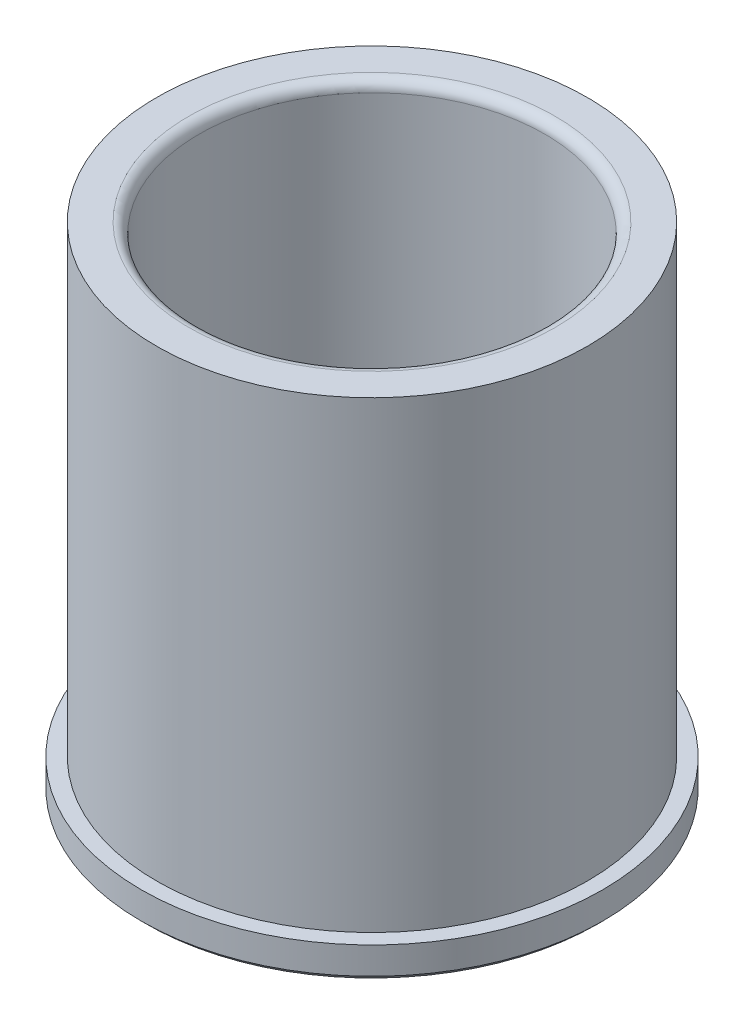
ISO-10303-21;
HEADER;
FILE_DESCRIPTION(('STEP AP214'),'2;1');
FILE_NAME('part.step','',(''),(''),'','','');
FILE_SCHEMA(('AUTOMOTIVE_DESIGN { 1 0 10303 214 1 1 1 1 }'));
ENDSEC;
DATA;
#1=APPLICATION_CONTEXT('core data for automotive mechanical design processes');
#2=APPLICATION_PROTOCOL_DEFINITION('international standard','automotive_design',2000,#1);
#3=PRODUCT_CONTEXT('',#1,'mechanical');
#4=PRODUCT('Part','Part','',(#3));
#5=PRODUCT_RELATED_PRODUCT_CATEGORY('part','',(#4));
#6=PRODUCT_DEFINITION_FORMATION('','',#4);
#7=PRODUCT_DEFINITION_CONTEXT('part definition',#1,'design');
#8=PRODUCT_DEFINITION('design','',#6,#7);
#9=PRODUCT_DEFINITION_SHAPE('','',#8);
#10=(LENGTH_UNIT() NAMED_UNIT(*) SI_UNIT(.MILLI.,.METRE.));
#11=(NAMED_UNIT(*) PLANE_ANGLE_UNIT() SI_UNIT($,.RADIAN.));
#12=(NAMED_UNIT(*) SI_UNIT($,.STERADIAN.) SOLID_ANGLE_UNIT());
#13=UNCERTAINTY_MEASURE_WITH_UNIT(LENGTH_MEASURE(1.E-05),#10,'distance_accuracy_value','');
#14=(GEOMETRIC_REPRESENTATION_CONTEXT(3) GLOBAL_UNCERTAINTY_ASSIGNED_CONTEXT((#13)) GLOBAL_UNIT_ASSIGNED_CONTEXT((#10,
#11,#12)) REPRESENTATION_CONTEXT('',''));
#15=CARTESIAN_POINT('',(0.,0.,0.));
#16=DIRECTION('',(0.,0.,1.));
#17=DIRECTION('',(1.,0.,0.));
#18=AXIS2_PLACEMENT_3D('',#15,#16,#17);
#19=CARTESIAN_POINT('',(3.49148336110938E-12,-1000.,0.));
#20=DIRECTION('',(0.,-1.,0.));
#21=DIRECTION('',(1.,0.,0.));
#22=AXIS2_PLACEMENT_3D('',#19,#20,#21);
#23=CYLINDRICAL_SURFACE('',#22,31.7563499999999);
#24=CARTESIAN_POINT('',(0.,4.7625,0.));
#25=DIRECTION('',(0.,-1.,0.));
#26=DIRECTION('',(1.,0.,0.));
#27=AXIS2_PLACEMENT_3D('',#24,#25,#26);
#28=CIRCLE('',#27,31.75635);
#29=CARTESIAN_POINT('',(31.75635,4.76250000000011,0.));
#30=VERTEX_POINT('',#29);
#31=EDGE_CURVE('E60',#30,#30,#28,.T.);
#32=ORIENTED_EDGE('',*,*,#31,.F.);
#33=EDGE_LOOP('',(#32));
#34=FACE_BOUND('',#33,.T.);
#35=CARTESIAN_POINT('',(-2.54965572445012E-13,73.0249999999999,0.));
#36=DIRECTION('',(0.,-1.,0.));
#37=DIRECTION('',(1.,0.,0.));
#38=AXIS2_PLACEMENT_3D('',#35,#36,#37);
#39=CIRCLE('',#38,31.7563499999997);
#40=CARTESIAN_POINT('',(31.7563499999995,73.025,0.));
#41=VERTEX_POINT('',#40);
#42=EDGE_CURVE('E39',#41,#41,#39,.T.);
#43=ORIENTED_EDGE('',*,*,#42,.T.);
#44=EDGE_LOOP('',(#43));
#45=FACE_BOUND('',#44,.T.);
#46=ADVANCED_FACE('F28',(#34,#45),#23,.T.);
#47=CARTESIAN_POINT('',(-31.75635,73.025,0.));
#48=DIRECTION('',(0.,-1.,0.));
#49=DIRECTION('',(1.,0.,0.));
#50=AXIS2_PLACEMENT_3D('',#47,#48,#49);
#51=PLANE('',#50);
#52=CARTESIAN_POINT('',(-2.54965572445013E-13,73.0250000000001,0.));
#53=DIRECTION('',(0.,-1.,0.));
#54=DIRECTION('',(1.,0.,0.));
#55=AXIS2_PLACEMENT_3D('',#52,#53,#54);
#56=CIRCLE('',#55,26.9874999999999);
#57=CARTESIAN_POINT('',(26.9874999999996,73.0250000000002,0.));
#58=VERTEX_POINT('',#57);
#59=EDGE_CURVE('E35',#58,#58,#56,.T.);
#60=ORIENTED_EDGE('',*,*,#59,.T.);
#61=EDGE_LOOP('',(#60));
#62=FACE_BOUND('',#61,.T.);
#63=ORIENTED_EDGE('',*,*,#42,.F.);
#64=EDGE_LOOP('',(#63));
#65=FACE_BOUND('',#64,.T.);
#66=ADVANCED_FACE('F68',(#62,#65),#51,.F.);
#67=CARTESIAN_POINT('',(3.49148336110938E-12,-1000.,0.));
#68=DIRECTION('',(0.,-1.,0.));
#69=DIRECTION('',(1.,0.,0.));
#70=AXIS2_PLACEMENT_3D('',#67,#68,#69);
#71=CYLINDRICAL_SURFACE('',#70,25.4634999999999);
#72=CARTESIAN_POINT('',(-2.49644551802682E-13,71.501,0.));
#73=DIRECTION('',(0.,-1.,0.));
#74=DIRECTION('',(1.,0.,0.));
#75=AXIS2_PLACEMENT_3D('',#72,#73,#74);
#76=CIRCLE('',#75,25.4634999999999);
#77=CARTESIAN_POINT('',(25.4634999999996,71.5010000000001,0.));
#78=VERTEX_POINT('',#77);
#79=EDGE_CURVE('E10',#78,#78,#76,.F.);
#80=ORIENTED_EDGE('',*,*,#79,.T.);
#81=EDGE_LOOP('',(#80));
#82=FACE_BOUND('',#81,.T.);
#83=CARTESIAN_POINT('',(0.,0.761999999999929,0.));
#84=DIRECTION('',(0.,-1.,0.));
#85=DIRECTION('',(1.,0.,0.));
#86=AXIS2_PLACEMENT_3D('',#83,#84,#85);
#87=CIRCLE('',#86,25.4635);
#88=CARTESIAN_POINT('',(25.4635,0.762000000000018,0.));
#89=VERTEX_POINT('',#88);
#90=EDGE_CURVE('E43',#89,#89,#87,.T.);
#91=ORIENTED_EDGE('',*,*,#90,.T.);
#92=EDGE_LOOP('',(#91));
#93=FACE_BOUND('',#92,.T.);
#94=ADVANCED_FACE('F72',(#82,#93),#71,.F.);
#95=CARTESIAN_POINT('',(0.,0.,0.));
#96=DIRECTION('',(0.,-1.,0.));
#97=DIRECTION('',(1.,0.,0.));
#98=AXIS2_PLACEMENT_3D('',#95,#96,#97);
#99=CONICAL_SURFACE('',#98,26.2255,0.785398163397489);
#100=ORIENTED_EDGE('',*,*,#90,.F.);
#101=EDGE_LOOP('',(#100));
#102=FACE_BOUND('',#101,.T.);
#103=CARTESIAN_POINT('',(0.,0.,0.));
#104=DIRECTION('',(0.,-1.,0.));
#105=DIRECTION('',(1.,0.,0.));
#106=AXIS2_PLACEMENT_3D('',#103,#104,#105);
#107=CIRCLE('',#106,26.2255);
#108=CARTESIAN_POINT('',(26.2255,0.,0.));
#109=VERTEX_POINT('',#108);
#110=EDGE_CURVE('E48',#109,#109,#107,.T.);
#111=ORIENTED_EDGE('',*,*,#110,.T.);
#112=EDGE_LOOP('',(#111));
#113=FACE_BOUND('',#112,.T.);
#114=ADVANCED_FACE('F77',(#102,#113),#99,.F.);
#115=CARTESIAN_POINT('',(-26.2255,0.,0.));
#116=DIRECTION('',(0.,1.,0.));
#117=DIRECTION('',(-1.,0.,0.));
#118=AXIS2_PLACEMENT_3D('',#115,#116,#117);
#119=PLANE('',#118);
#120=ORIENTED_EDGE('',*,*,#110,.F.);
#121=EDGE_LOOP('',(#120));
#122=FACE_BOUND('',#121,.T.);
#123=CARTESIAN_POINT('',(0.,2.22044604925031E-13,0.));
#124=DIRECTION('',(0.,-1.,0.));
#125=DIRECTION('',(1.,0.,0.));
#126=AXIS2_PLACEMENT_3D('',#123,#124,#125);
#127=CIRCLE('',#126,33.2359);
#128=CARTESIAN_POINT('',(33.2359,3.38087196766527E-13,0.));
#129=VERTEX_POINT('',#128);
#130=EDGE_CURVE('E51',#129,#129,#127,.T.);
#131=ORIENTED_EDGE('',*,*,#130,.T.);
#132=EDGE_LOOP('',(#131));
#133=FACE_BOUND('',#132,.T.);
#134=ADVANCED_FACE('F82',(#122,#133),#119,.F.);
#135=CARTESIAN_POINT('',(0.,0.762000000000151,0.));
#136=DIRECTION('',(0.,1.,0.));
#137=DIRECTION('',(-1.,0.,0.));
#138=AXIS2_PLACEMENT_3D('',#135,#136,#137);
#139=CONICAL_SURFACE('',#138,33.9979,0.785398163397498);
#140=ORIENTED_EDGE('',*,*,#130,.F.);
#141=EDGE_LOOP('',(#140));
#142=FACE_BOUND('',#141,.T.);
#143=CARTESIAN_POINT('',(0.,0.762000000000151,0.));
#144=DIRECTION('',(0.,-1.,0.));
#145=DIRECTION('',(1.,0.,0.));
#146=AXIS2_PLACEMENT_3D('',#143,#144,#145);
#147=CIRCLE('',#146,33.9979);
#148=CARTESIAN_POINT('',(33.9979,0.76200000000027,0.));
#149=VERTEX_POINT('',#148);
#150=EDGE_CURVE('E54',#149,#149,#147,.T.);
#151=ORIENTED_EDGE('',*,*,#150,.T.);
#152=EDGE_LOOP('',(#151));
#153=FACE_BOUND('',#152,.T.);
#154=ADVANCED_FACE('F86',(#142,#153),#139,.T.);
#155=CARTESIAN_POINT('',(3.49148336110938E-12,-1000.,0.));
#156=DIRECTION('',(0.,-1.,0.));
#157=DIRECTION('',(1.,0.,0.));
#158=AXIS2_PLACEMENT_3D('',#155,#156,#157);
#159=CYLINDRICAL_SURFACE('',#158,33.9979);
#160=ORIENTED_EDGE('',*,*,#150,.F.);
#161=EDGE_LOOP('',(#160));
#162=FACE_BOUND('',#161,.T.);
#163=CARTESIAN_POINT('',(0.,4.76250000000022,0.));
#164=DIRECTION('',(0.,-1.,0.));
#165=DIRECTION('',(1.,0.,0.));
#166=AXIS2_PLACEMENT_3D('',#163,#164,#165);
#167=CIRCLE('',#166,33.9979);
#168=CARTESIAN_POINT('',(33.9979,4.76250000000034,0.));
#169=VERTEX_POINT('',#168);
#170=EDGE_CURVE('E57',#169,#169,#167,.T.);
#171=ORIENTED_EDGE('',*,*,#170,.T.);
#172=EDGE_LOOP('',(#171));
#173=FACE_BOUND('',#172,.T.);
#174=ADVANCED_FACE('F90',(#162,#173),#159,.T.);
#175=CARTESIAN_POINT('',(-33.9979,4.76249999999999,0.));
#176=DIRECTION('',(0.,-1.,0.));
#177=DIRECTION('',(1.,0.,0.));
#178=AXIS2_PLACEMENT_3D('',#175,#176,#177);
#179=PLANE('',#178);
#180=ORIENTED_EDGE('',*,*,#170,.F.);
#181=EDGE_LOOP('',(#180));
#182=FACE_BOUND('',#181,.T.);
#183=ORIENTED_EDGE('',*,*,#31,.T.);
#184=EDGE_LOOP('',(#183));
#185=FACE_BOUND('',#184,.T.);
#186=ADVANCED_FACE('F64',(#182,#185),#179,.F.);
#187=CARTESIAN_POINT('',(-2.49644551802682E-13,71.501,0.));
#188=DIRECTION('',(0.,-1.,0.));
#189=DIRECTION('',(1.,0.,0.));
#190=AXIS2_PLACEMENT_3D('',#187,#188,#189);
#191=TOROIDAL_SURFACE('',#190,26.9874999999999,1.524);
#192=ORIENTED_EDGE('',*,*,#79,.F.);
#193=EDGE_LOOP('',(#192));
#194=FACE_BOUND('',#193,.T.);
#195=ORIENTED_EDGE('',*,*,#59,.F.);
#196=EDGE_LOOP('',(#195));
#197=FACE_BOUND('',#196,.T.);
#198=ADVANCED_FACE('F30',(#194,#197),#191,.T.);
#199=CLOSED_SHELL('',(#46,#66,#94,#114,#134,#154,#174,#186,#198));
#200=MANIFOLD_SOLID_BREP('B2',#199);
#201=ADVANCED_BREP_SHAPE_REPRESENTATION('',(#18,#200),#14);
#202=SHAPE_DEFINITION_REPRESENTATION(#9,#201);
ENDSEC;
END-ISO-10303-21;
